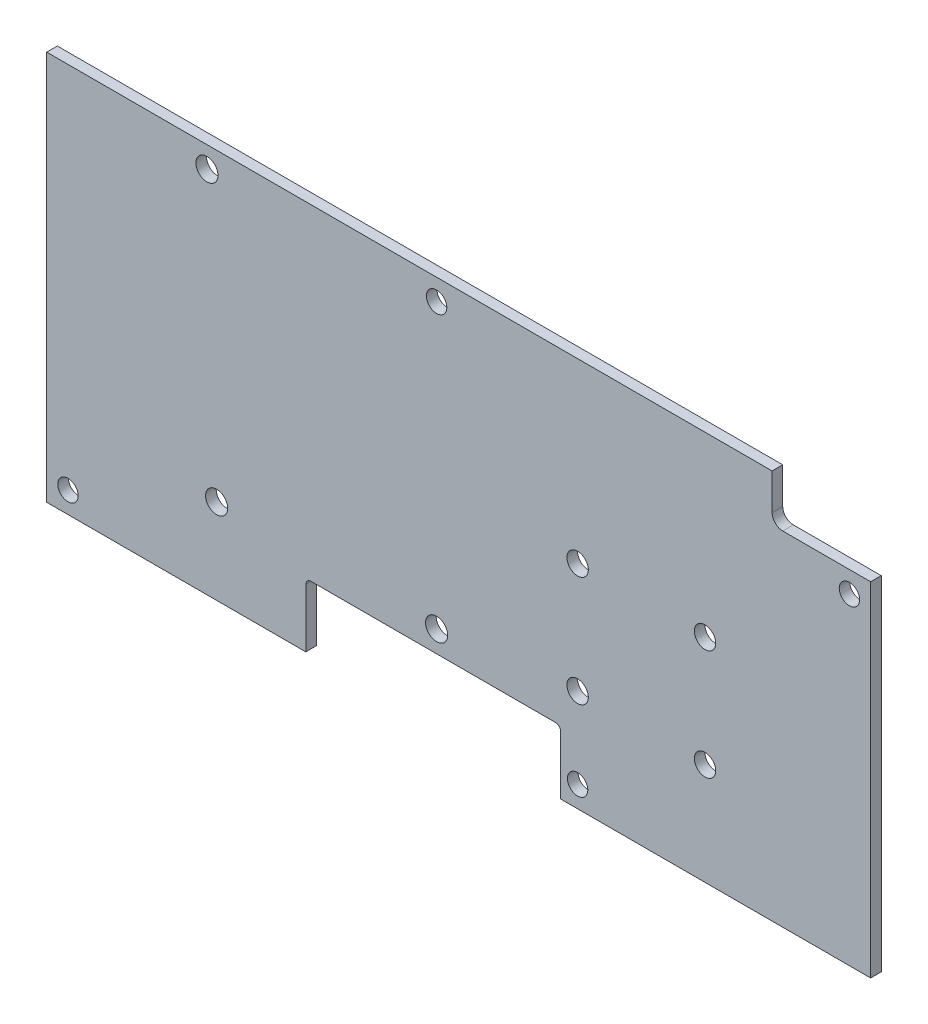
ISO-10303-21;
HEADER;
FILE_DESCRIPTION(('STEP AP214'),'2;1');
FILE_NAME('part.step','',(''),(''),'','','');
FILE_SCHEMA(('AUTOMOTIVE_DESIGN { 1 0 10303 214 1 1 1 1 }'));
ENDSEC;
DATA;
#1=APPLICATION_CONTEXT('core data for automotive mechanical design processes');
#2=APPLICATION_PROTOCOL_DEFINITION('international standard','automotive_design',2000,#1);
#3=PRODUCT_CONTEXT('',#1,'mechanical');
#4=PRODUCT('Part','Part','',(#3));
#5=PRODUCT_RELATED_PRODUCT_CATEGORY('part','',(#4));
#6=PRODUCT_DEFINITION_FORMATION('','',#4);
#7=PRODUCT_DEFINITION_CONTEXT('part definition',#1,'design');
#8=PRODUCT_DEFINITION('design','',#6,#7);
#9=PRODUCT_DEFINITION_SHAPE('','',#8);
#10=(LENGTH_UNIT() NAMED_UNIT(*) SI_UNIT(.MILLI.,.METRE.));
#11=(NAMED_UNIT(*) PLANE_ANGLE_UNIT() SI_UNIT($,.RADIAN.));
#12=(NAMED_UNIT(*) SI_UNIT($,.STERADIAN.) SOLID_ANGLE_UNIT());
#13=UNCERTAINTY_MEASURE_WITH_UNIT(LENGTH_MEASURE(1.E-05),#10,'distance_accuracy_value','');
#14=(GEOMETRIC_REPRESENTATION_CONTEXT(3) GLOBAL_UNCERTAINTY_ASSIGNED_CONTEXT((#13)) GLOBAL_UNIT_ASSIGNED_CONTEXT((#10,
#11,#12)) REPRESENTATION_CONTEXT('',''));
#15=CARTESIAN_POINT('',(0.,0.,0.));
#16=DIRECTION('',(0.,0.,1.));
#17=DIRECTION('',(1.,0.,0.));
#18=AXIS2_PLACEMENT_3D('',#15,#16,#17);
#19=CARTESIAN_POINT('',(24.765,48.895,-9.906));
#20=DIRECTION('',(0.,-1.,0.));
#21=DIRECTION('',(0.,0.,-1.));
#22=AXIS2_PLACEMENT_3D('',#19,#20,#21);
#23=PLANE('',#22);
#24=DIRECTION('',(0.,0.,1.));
#25=VECTOR('',#24,1.);
#26=CARTESIAN_POINT('',(101.6,48.895,-9.906));
#27=LINE('',#26,#25);
#28=CARTESIAN_POINT('',(101.6,48.895,0.));
#29=VERTEX_POINT('',#28);
#30=CARTESIAN_POINT('',(101.6,48.895,1.5875));
#31=VERTEX_POINT('',#30);
#32=EDGE_CURVE('E132',#29,#31,#27,.T.);
#33=ORIENTED_EDGE('',*,*,#32,.F.);
#34=DIRECTION('',(-1.,0.,0.));
#35=VECTOR('',#34,1.);
#36=CARTESIAN_POINT('',(0.,48.895,0.));
#37=LINE('',#36,#35);
#38=CARTESIAN_POINT('',(147.955,48.895,0.));
#39=VERTEX_POINT('',#38);
#40=EDGE_CURVE('E162',#39,#29,#37,.T.);
#41=ORIENTED_EDGE('',*,*,#40,.F.);
#42=DIRECTION('',(0.,0.,1.));
#43=VECTOR('',#42,1.);
#44=CARTESIAN_POINT('',(147.955,48.895,-9.906));
#45=LINE('',#44,#43);
#46=CARTESIAN_POINT('',(147.955,48.895,1.5875));
#47=VERTEX_POINT('',#46);
#48=EDGE_CURVE('E153',#39,#47,#45,.T.);
#49=ORIENTED_EDGE('',*,*,#48,.T.);
#50=DIRECTION('',(-1.,0.,0.));
#51=VECTOR('',#50,1.);
#52=CARTESIAN_POINT('',(0.,48.895,1.5875));
#53=LINE('',#52,#51);
#54=EDGE_CURVE('E147',#47,#31,#53,.T.);
#55=ORIENTED_EDGE('',*,*,#54,.T.);
#56=EDGE_LOOP('',(#33,#41,#49,#55));
#57=FACE_BOUND('',#56,.T.);
#58=ADVANCED_FACE('F39',(#57),#23,.T.);
#59=CARTESIAN_POINT('',(0.,165.1,0.));
#60=DIRECTION('',(0.,0.,-1.));
#61=DIRECTION('',(-1.,0.,0.));
#62=AXIS2_PLACEMENT_3D('',#59,#60,#61);
#63=PLANE('',#62);
#64=DIRECTION('',(0.,1.,0.));
#65=VECTOR('',#64,1.);
#66=CARTESIAN_POINT('',(101.6,46.8737804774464,0.));
#67=LINE('',#66,#65);
#68=CARTESIAN_POINT('',(101.6,57.62625,0.));
#69=VERTEX_POINT('',#68);
#70=EDGE_CURVE('E135',#29,#69,#67,.T.);
#71=ORIENTED_EDGE('',*,*,#70,.T.);
#72=CARTESIAN_POINT('',(100.80625,57.62625,0.));
#73=DIRECTION('',(0.,0.,-1.));
#74=DIRECTION('',(-1.,0.,0.));
#75=AXIS2_PLACEMENT_3D('',#72,#73,#74);
#76=CIRCLE('',#75,0.79375);
#77=CARTESIAN_POINT('',(100.80625,58.42,0.));
#78=VERTEX_POINT('',#77);
#79=EDGE_CURVE('E12',#69,#78,#76,.F.);
#80=ORIENTED_EDGE('',*,*,#79,.T.);
#81=DIRECTION('',(-1.,0.,0.));
#82=VECTOR('',#81,1.);
#83=CARTESIAN_POINT('',(101.6,58.42,0.));
#84=LINE('',#83,#82);
#85=CARTESIAN_POINT('',(64.29375,58.42,0.));
#86=VERTEX_POINT('',#85);
#87=EDGE_CURVE('E264',#78,#86,#84,.T.);
#88=ORIENTED_EDGE('',*,*,#87,.T.);
#89=CARTESIAN_POINT('',(64.29375,57.62625,0.));
#90=DIRECTION('',(0.,0.,-1.));
#91=DIRECTION('',(-1.,0.,0.));
#92=AXIS2_PLACEMENT_3D('',#89,#90,#91);
#93=CIRCLE('',#92,0.79375);
#94=CARTESIAN_POINT('',(63.5,57.62625,0.));
#95=VERTEX_POINT('',#94);
#96=EDGE_CURVE('E253',#86,#95,#93,.F.);
#97=ORIENTED_EDGE('',*,*,#96,.T.);
#98=DIRECTION('',(0.,-1.,0.));
#99=VECTOR('',#98,1.);
#100=CARTESIAN_POINT('',(63.5,46.8737804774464,0.));
#101=LINE('',#100,#99);
#102=CARTESIAN_POINT('',(63.5,48.895,0.));
#103=VERTEX_POINT('',#102);
#104=EDGE_CURVE('E262',#95,#103,#101,.T.);
#105=ORIENTED_EDGE('',*,*,#104,.T.);
#106=CARTESIAN_POINT('',(24.765,48.895,0.));
#107=VERTEX_POINT('',#106);
#108=EDGE_CURVE('E362',#103,#107,#37,.T.);
#109=ORIENTED_EDGE('',*,*,#108,.T.);
#110=DIRECTION('',(0.,1.,0.));
#111=VECTOR('',#110,1.);
#112=CARTESIAN_POINT('',(24.765,165.1,0.));
#113=LINE('',#112,#111);
#114=CARTESIAN_POINT('',(24.765,107.188,0.));
#115=VERTEX_POINT('',#114);
#116=EDGE_CURVE('E172',#107,#115,#113,.T.);
#117=ORIENTED_EDGE('',*,*,#116,.T.);
#118=DIRECTION('',(1.,0.,0.));
#119=VECTOR('',#118,1.);
#120=CARTESIAN_POINT('',(0.,107.188,0.));
#121=LINE('',#120,#119);
#122=CARTESIAN_POINT('',(133.223,107.188,0.));
#123=VERTEX_POINT('',#122);
#124=EDGE_CURVE('E168',#115,#123,#121,.T.);
#125=ORIENTED_EDGE('',*,*,#124,.T.);
#126=DIRECTION('',(0.,-1.,0.));
#127=VECTOR('',#126,1.);
#128=CARTESIAN_POINT('',(133.223,100.203,0.));
#129=LINE('',#128,#127);
#130=CARTESIAN_POINT('',(133.223,101.7905,0.));
#131=VERTEX_POINT('',#130);
#132=EDGE_CURVE('E344',#123,#131,#129,.T.);
#133=ORIENTED_EDGE('',*,*,#132,.T.);
#134=CARTESIAN_POINT('',(134.8105,101.7905,0.));
#135=DIRECTION('',(0.,0.,-1.));
#136=DIRECTION('',(-1.,0.,0.));
#137=AXIS2_PLACEMENT_3D('',#134,#135,#136);
#138=CIRCLE('',#137,1.5875);
#139=CARTESIAN_POINT('',(134.8105,100.203,0.));
#140=VERTEX_POINT('',#139);
#141=EDGE_CURVE('E232',#131,#140,#138,.F.);
#142=ORIENTED_EDGE('',*,*,#141,.T.);
#143=DIRECTION('',(1.,0.,0.));
#144=VECTOR('',#143,1.);
#145=CARTESIAN_POINT('',(150.814561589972,100.203,0.));
#146=LINE('',#145,#144);
#147=CARTESIAN_POINT('',(147.955,100.203,0.));
#148=VERTEX_POINT('',#147);
#149=EDGE_CURVE('E348',#140,#148,#146,.T.);
#150=ORIENTED_EDGE('',*,*,#149,.T.);
#151=DIRECTION('',(0.,-1.,0.));
#152=VECTOR('',#151,1.);
#153=CARTESIAN_POINT('',(147.955,165.1,0.));
#154=LINE('',#153,#152);
#155=EDGE_CURVE('E155',#148,#39,#154,.T.);
#156=ORIENTED_EDGE('',*,*,#155,.T.);
#157=ORIENTED_EDGE('',*,*,#40,.T.);
#158=EDGE_LOOP('',(#71,#80,#88,#97,#105,#109,#117,#125,#133,#142,#150,#156,#157));
#159=FACE_BOUND('',#158,.T.);
#160=CARTESIAN_POINT('',(104.14,80.645,0.));
#161=DIRECTION('',(0.,0.,1.));
#162=DIRECTION('',(1.,0.,0.));
#163=AXIS2_PLACEMENT_3D('',#160,#161,#162);
#164=CIRCLE('',#163,1.6002);
#165=CARTESIAN_POINT('',(105.7402,80.645,0.));
#166=VERTEX_POINT('',#165);
#167=EDGE_CURVE('E296',#166,#166,#164,.T.);
#168=ORIENTED_EDGE('',*,*,#167,.T.);
#169=EDGE_LOOP('',(#168));
#170=FACE_BOUND('',#169,.T.);
#171=CARTESIAN_POINT('',(123.19,64.135,0.));
#172=DIRECTION('',(0.,0.,1.));
#173=DIRECTION('',(1.,0.,0.));
#174=AXIS2_PLACEMENT_3D('',#171,#172,#173);
#175=CIRCLE('',#174,1.6002);
#176=CARTESIAN_POINT('',(124.7902,64.135,0.));
#177=VERTEX_POINT('',#176);
#178=EDGE_CURVE('E305',#177,#177,#175,.T.);
#179=ORIENTED_EDGE('',*,*,#178,.T.);
#180=EDGE_LOOP('',(#179));
#181=FACE_BOUND('',#180,.T.);
#182=CARTESIAN_POINT('',(123.19,80.645,0.));
#183=DIRECTION('',(0.,0.,1.));
#184=DIRECTION('',(1.,0.,0.));
#185=AXIS2_PLACEMENT_3D('',#182,#183,#184);
#186=CIRCLE('',#185,1.6002);
#187=CARTESIAN_POINT('',(124.7902,80.645,0.));
#188=VERTEX_POINT('',#187);
#189=EDGE_CURVE('E288',#188,#188,#186,.T.);
#190=ORIENTED_EDGE('',*,*,#189,.T.);
#191=EDGE_LOOP('',(#190));
#192=FACE_BOUND('',#191,.T.);
#193=CARTESIAN_POINT('',(104.14,64.135,0.));
#194=DIRECTION('',(0.,0.,1.));
#195=DIRECTION('',(1.,0.,0.));
#196=AXIS2_PLACEMENT_3D('',#193,#194,#195);
#197=CIRCLE('',#196,1.6002);
#198=CARTESIAN_POINT('',(105.7402,64.135,0.));
#199=VERTEX_POINT('',#198);
#200=EDGE_CURVE('E312',#199,#199,#197,.T.);
#201=ORIENTED_EDGE('',*,*,#200,.T.);
#202=EDGE_LOOP('',(#201));
#203=FACE_BOUND('',#202,.T.);
#204=CARTESIAN_POINT('',(48.7172,104.013,0.));
#205=DIRECTION('',(0.,0.,1.));
#206=DIRECTION('',(1.,0.,0.));
#207=AXIS2_PLACEMENT_3D('',#204,#205,#206);
#208=CIRCLE('',#207,1.65100000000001);
#209=CARTESIAN_POINT('',(50.3682,104.013,0.));
#210=VERTEX_POINT('',#209);
#211=EDGE_CURVE('E320',#210,#210,#208,.T.);
#212=ORIENTED_EDGE('',*,*,#211,.T.);
#213=EDGE_LOOP('',(#212));
#214=FACE_BOUND('',#213,.T.);
#215=CARTESIAN_POINT('',(50.165,61.6458,0.));
#216=DIRECTION('',(0.,0.,1.));
#217=DIRECTION('',(1.,0.,0.));
#218=AXIS2_PLACEMENT_3D('',#215,#216,#217);
#219=CIRCLE('',#218,1.651);
#220=CARTESIAN_POINT('',(51.816,61.6458,0.));
#221=VERTEX_POINT('',#220);
#222=EDGE_CURVE('E329',#221,#221,#219,.T.);
#223=ORIENTED_EDGE('',*,*,#222,.T.);
#224=EDGE_LOOP('',(#223));
#225=FACE_BOUND('',#224,.T.);
#226=CARTESIAN_POINT('',(83.058,61.6458,0.));
#227=DIRECTION('',(0.,0.,1.));
#228=DIRECTION('',(1.,0.,0.));
#229=AXIS2_PLACEMENT_3D('',#226,#227,#228);
#230=CIRCLE('',#229,1.65100000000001);
#231=CARTESIAN_POINT('',(84.709,61.6458,0.));
#232=VERTEX_POINT('',#231);
#233=EDGE_CURVE('E337',#232,#232,#230,.T.);
#234=ORIENTED_EDGE('',*,*,#233,.T.);
#235=EDGE_LOOP('',(#234));
#236=FACE_BOUND('',#235,.T.);
#237=CARTESIAN_POINT('',(27.94,52.07,0.));
#238=DIRECTION('',(0.,0.,-1.));
#239=DIRECTION('',(-1.,0.,0.));
#240=AXIS2_PLACEMENT_3D('',#237,#238,#239);
#241=CIRCLE('',#240,1.524);
#242=CARTESIAN_POINT('',(26.416,52.07,0.));
#243=VERTEX_POINT('',#242);
#244=EDGE_CURVE('E195',#243,#243,#241,.T.);
#245=ORIENTED_EDGE('',*,*,#244,.F.);
#246=EDGE_LOOP('',(#245));
#247=FACE_BOUND('',#246,.T.);
#248=CARTESIAN_POINT('',(104.14,52.07,0.));
#249=DIRECTION('',(0.,0.,-1.));
#250=DIRECTION('',(-1.,0.,0.));
#251=AXIS2_PLACEMENT_3D('',#248,#249,#250);
#252=CIRCLE('',#251,1.52399999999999);
#253=CARTESIAN_POINT('',(102.616,52.07,0.));
#254=VERTEX_POINT('',#253);
#255=EDGE_CURVE('E190',#254,#254,#252,.T.);
#256=ORIENTED_EDGE('',*,*,#255,.F.);
#257=EDGE_LOOP('',(#256));
#258=FACE_BOUND('',#257,.T.);
#259=CARTESIAN_POINT('',(144.78,97.028,0.));
#260=DIRECTION('',(0.,0.,-1.));
#261=DIRECTION('',(-1.,0.,0.));
#262=AXIS2_PLACEMENT_3D('',#259,#260,#261);
#263=CIRCLE('',#262,1.52400000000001);
#264=CARTESIAN_POINT('',(143.256,97.028,0.));
#265=VERTEX_POINT('',#264);
#266=EDGE_CURVE('E185',#265,#265,#263,.T.);
#267=ORIENTED_EDGE('',*,*,#266,.F.);
#268=EDGE_LOOP('',(#267));
#269=FACE_BOUND('',#268,.T.);
#270=CARTESIAN_POINT('',(83.058,104.013,0.));
#271=DIRECTION('',(0.,0.,-1.));
#272=DIRECTION('',(-1.,0.,0.));
#273=AXIS2_PLACEMENT_3D('',#270,#271,#272);
#274=CIRCLE('',#273,1.52399999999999);
#275=CARTESIAN_POINT('',(81.534,104.013,0.));
#276=VERTEX_POINT('',#275);
#277=EDGE_CURVE('E180',#276,#276,#274,.T.);
#278=ORIENTED_EDGE('',*,*,#277,.F.);
#279=EDGE_LOOP('',(#278));
#280=FACE_BOUND('',#279,.T.);
#281=ADVANCED_FACE('F260',(#159,#170,#181,#192,#203,#214,#225,#236,#247,#258,#269,#280),#63,.T.);
#282=CARTESIAN_POINT('',(0.,165.1,1.5875));
#283=DIRECTION('',(0.,0.,-1.));
#284=DIRECTION('',(-1.,0.,0.));
#285=AXIS2_PLACEMENT_3D('',#282,#283,#284);
#286=PLANE('',#285);
#287=CARTESIAN_POINT('',(104.14,80.645,1.5875));
#288=DIRECTION('',(0.,0.,1.));
#289=DIRECTION('',(1.,0.,0.));
#290=AXIS2_PLACEMENT_3D('',#287,#288,#289);
#291=CIRCLE('',#290,1.6002);
#292=CARTESIAN_POINT('',(105.7402,80.645,1.5875));
#293=VERTEX_POINT('',#292);
#294=EDGE_CURVE('E301',#293,#293,#291,.T.);
#295=ORIENTED_EDGE('',*,*,#294,.F.);
#296=EDGE_LOOP('',(#295));
#297=FACE_BOUND('',#296,.T.);
#298=CARTESIAN_POINT('',(123.19,64.135,1.5875));
#299=DIRECTION('',(0.,0.,1.));
#300=DIRECTION('',(1.,0.,0.));
#301=AXIS2_PLACEMENT_3D('',#298,#299,#300);
#302=CIRCLE('',#301,1.6002);
#303=CARTESIAN_POINT('',(124.7902,64.135,1.5875));
#304=VERTEX_POINT('',#303);
#305=EDGE_CURVE('E292',#304,#304,#302,.T.);
#306=ORIENTED_EDGE('',*,*,#305,.F.);
#307=EDGE_LOOP('',(#306));
#308=FACE_BOUND('',#307,.T.);
#309=CARTESIAN_POINT('',(123.19,80.645,1.5875));
#310=DIRECTION('',(0.,0.,1.));
#311=DIRECTION('',(1.,0.,0.));
#312=AXIS2_PLACEMENT_3D('',#309,#310,#311);
#313=CIRCLE('',#312,1.6002);
#314=CARTESIAN_POINT('',(124.7902,80.645,1.5875));
#315=VERTEX_POINT('',#314);
#316=EDGE_CURVE('E274',#315,#315,#313,.T.);
#317=ORIENTED_EDGE('',*,*,#316,.F.);
#318=EDGE_LOOP('',(#317));
#319=FACE_BOUND('',#318,.T.);
#320=CARTESIAN_POINT('',(104.14,64.135,1.5875));
#321=DIRECTION('',(0.,0.,1.));
#322=DIRECTION('',(1.,0.,0.));
#323=AXIS2_PLACEMENT_3D('',#320,#321,#322);
#324=CIRCLE('',#323,1.6002);
#325=CARTESIAN_POINT('',(105.7402,64.135,1.5875));
#326=VERTEX_POINT('',#325);
#327=EDGE_CURVE('E300',#326,#326,#324,.T.);
#328=ORIENTED_EDGE('',*,*,#327,.F.);
#329=EDGE_LOOP('',(#328));
#330=FACE_BOUND('',#329,.T.);
#331=CARTESIAN_POINT('',(48.7172,104.013,1.5875));
#332=DIRECTION('',(0.,0.,1.));
#333=DIRECTION('',(1.,0.,0.));
#334=AXIS2_PLACEMENT_3D('',#331,#332,#333);
#335=CIRCLE('',#334,1.65100000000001);
#336=CARTESIAN_POINT('',(50.3682,104.013,1.5875));
#337=VERTEX_POINT('',#336);
#338=EDGE_CURVE('E325',#337,#337,#335,.T.);
#339=ORIENTED_EDGE('',*,*,#338,.F.);
#340=EDGE_LOOP('',(#339));
#341=FACE_BOUND('',#340,.T.);
#342=CARTESIAN_POINT('',(50.165,61.6458,1.5875));
#343=DIRECTION('',(0.,0.,1.));
#344=DIRECTION('',(1.,0.,0.));
#345=AXIS2_PLACEMENT_3D('',#342,#343,#344);
#346=CIRCLE('',#345,1.651);
#347=CARTESIAN_POINT('',(51.816,61.6458,1.5875));
#348=VERTEX_POINT('',#347);
#349=EDGE_CURVE('E333',#348,#348,#346,.T.);
#350=ORIENTED_EDGE('',*,*,#349,.F.);
#351=EDGE_LOOP('',(#350));
#352=FACE_BOUND('',#351,.T.);
#353=CARTESIAN_POINT('',(83.058,61.6458,1.5875));
#354=DIRECTION('',(0.,0.,1.));
#355=DIRECTION('',(1.,0.,0.));
#356=AXIS2_PLACEMENT_3D('',#353,#354,#355);
#357=CIRCLE('',#356,1.65100000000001);
#358=CARTESIAN_POINT('',(84.709,61.6458,1.5875));
#359=VERTEX_POINT('',#358);
#360=EDGE_CURVE('E316',#359,#359,#357,.T.);
#361=ORIENTED_EDGE('',*,*,#360,.F.);
#362=EDGE_LOOP('',(#361));
#363=FACE_BOUND('',#362,.T.);
#364=CARTESIAN_POINT('',(27.94,52.07,1.5875));
#365=DIRECTION('',(0.,0.,1.));
#366=DIRECTION('',(1.,0.,0.));
#367=AXIS2_PLACEMENT_3D('',#364,#365,#366);
#368=CIRCLE('',#367,1.524);
#369=CARTESIAN_POINT('',(29.464,52.07,1.5875));
#370=VERTEX_POINT('',#369);
#371=EDGE_CURVE('E191',#370,#370,#368,.T.);
#372=ORIENTED_EDGE('',*,*,#371,.F.);
#373=EDGE_LOOP('',(#372));
#374=FACE_BOUND('',#373,.T.);
#375=CARTESIAN_POINT('',(104.14,52.07,1.5875));
#376=DIRECTION('',(0.,0.,1.));
#377=DIRECTION('',(1.,0.,0.));
#378=AXIS2_PLACEMENT_3D('',#375,#376,#377);
#379=CIRCLE('',#378,1.52399999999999);
#380=CARTESIAN_POINT('',(105.664,52.07,1.5875));
#381=VERTEX_POINT('',#380);
#382=EDGE_CURVE('E186',#381,#381,#379,.T.);
#383=ORIENTED_EDGE('',*,*,#382,.F.);
#384=EDGE_LOOP('',(#383));
#385=FACE_BOUND('',#384,.T.);
#386=CARTESIAN_POINT('',(144.78,97.028,1.5875));
#387=DIRECTION('',(0.,0.,1.));
#388=DIRECTION('',(-1.,0.,0.));
#389=AXIS2_PLACEMENT_3D('',#386,#387,#388);
#390=CIRCLE('',#389,1.52400000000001);
#391=CARTESIAN_POINT('',(143.256,97.028,1.5875));
#392=VERTEX_POINT('',#391);
#393=EDGE_CURVE('E181',#392,#392,#390,.T.);
#394=ORIENTED_EDGE('',*,*,#393,.F.);
#395=EDGE_LOOP('',(#394));
#396=FACE_BOUND('',#395,.T.);
#397=CARTESIAN_POINT('',(83.058,104.013,1.5875));
#398=DIRECTION('',(0.,0.,1.));
#399=DIRECTION('',(-1.,0.,0.));
#400=AXIS2_PLACEMENT_3D('',#397,#398,#399);
#401=CIRCLE('',#400,1.52399999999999);
#402=CARTESIAN_POINT('',(81.534,104.013,1.5875));
#403=VERTEX_POINT('',#402);
#404=EDGE_CURVE('E176',#403,#403,#401,.T.);
#405=ORIENTED_EDGE('',*,*,#404,.F.);
#406=EDGE_LOOP('',(#405));
#407=FACE_BOUND('',#406,.T.);
#408=DIRECTION('',(-1.,0.,0.));
#409=VECTOR('',#408,1.);
#410=CARTESIAN_POINT('',(101.6,58.42,1.5875));
#411=LINE('',#410,#409);
#412=CARTESIAN_POINT('',(100.80625,58.42,1.5875));
#413=VERTEX_POINT('',#412);
#414=CARTESIAN_POINT('',(64.29375,58.42,1.5875));
#415=VERTEX_POINT('',#414);
#416=EDGE_CURVE('E149',#413,#415,#411,.T.);
#417=ORIENTED_EDGE('',*,*,#416,.F.);
#418=CARTESIAN_POINT('',(100.80625,57.62625,1.5875));
#419=DIRECTION('',(0.,0.,-1.));
#420=DIRECTION('',(-1.,0.,0.));
#421=AXIS2_PLACEMENT_3D('',#418,#419,#420);
#422=CIRCLE('',#421,0.79375);
#423=CARTESIAN_POINT('',(101.6,57.62625,1.5875));
#424=VERTEX_POINT('',#423);
#425=EDGE_CURVE('E48',#413,#424,#422,.T.);
#426=ORIENTED_EDGE('',*,*,#425,.T.);
#427=DIRECTION('',(0.,1.,0.));
#428=VECTOR('',#427,1.);
#429=CARTESIAN_POINT('',(101.6,46.8737804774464,1.5875));
#430=LINE('',#429,#428);
#431=EDGE_CURVE('E134',#31,#424,#430,.T.);
#432=ORIENTED_EDGE('',*,*,#431,.F.);
#433=ORIENTED_EDGE('',*,*,#54,.F.);
#434=DIRECTION('',(0.,-1.,0.));
#435=VECTOR('',#434,1.);
#436=CARTESIAN_POINT('',(147.955,165.1,1.5875));
#437=LINE('',#436,#435);
#438=CARTESIAN_POINT('',(147.955,100.203,1.5875));
#439=VERTEX_POINT('',#438);
#440=EDGE_CURVE('E160',#439,#47,#437,.T.);
#441=ORIENTED_EDGE('',*,*,#440,.F.);
#442=DIRECTION('',(1.,0.,0.));
#443=VECTOR('',#442,1.);
#444=CARTESIAN_POINT('',(150.814561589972,100.203,1.5875));
#445=LINE('',#444,#443);
#446=CARTESIAN_POINT('',(134.8105,100.203,1.5875));
#447=VERTEX_POINT('',#446);
#448=EDGE_CURVE('E349',#447,#439,#445,.T.);
#449=ORIENTED_EDGE('',*,*,#448,.F.);
#450=CARTESIAN_POINT('',(134.8105,101.7905,1.5875));
#451=DIRECTION('',(0.,0.,-1.));
#452=DIRECTION('',(-1.,0.,0.));
#453=AXIS2_PLACEMENT_3D('',#450,#451,#452);
#454=CIRCLE('',#453,1.5875);
#455=CARTESIAN_POINT('',(133.223,101.7905,1.5875));
#456=VERTEX_POINT('',#455);
#457=EDGE_CURVE('E229',#447,#456,#454,.T.);
#458=ORIENTED_EDGE('',*,*,#457,.T.);
#459=DIRECTION('',(0.,-1.,0.));
#460=VECTOR('',#459,1.);
#461=CARTESIAN_POINT('',(133.223,100.203,1.5875));
#462=LINE('',#461,#460);
#463=CARTESIAN_POINT('',(133.223,107.188,1.5875));
#464=VERTEX_POINT('',#463);
#465=EDGE_CURVE('E324',#464,#456,#462,.T.);
#466=ORIENTED_EDGE('',*,*,#465,.F.);
#467=DIRECTION('',(1.,0.,0.));
#468=VECTOR('',#467,1.);
#469=CARTESIAN_POINT('',(0.,107.188,1.5875));
#470=LINE('',#469,#468);
#471=CARTESIAN_POINT('',(24.765,107.188,1.5875));
#472=VERTEX_POINT('',#471);
#473=EDGE_CURVE('E199',#472,#464,#470,.T.);
#474=ORIENTED_EDGE('',*,*,#473,.F.);
#475=DIRECTION('',(0.,1.,0.));
#476=VECTOR('',#475,1.);
#477=CARTESIAN_POINT('',(24.765,165.1,1.5875));
#478=LINE('',#477,#476);
#479=CARTESIAN_POINT('',(24.765,48.895,1.5875));
#480=VERTEX_POINT('',#479);
#481=EDGE_CURVE('E212',#480,#472,#478,.T.);
#482=ORIENTED_EDGE('',*,*,#481,.F.);
#483=CARTESIAN_POINT('',(63.5,48.895,1.5875));
#484=VERTEX_POINT('',#483);
#485=EDGE_CURVE('E156',#484,#480,#53,.T.);
#486=ORIENTED_EDGE('',*,*,#485,.F.);
#487=DIRECTION('',(0.,-1.,0.));
#488=VECTOR('',#487,1.);
#489=CARTESIAN_POINT('',(63.5,46.8737804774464,1.5875));
#490=LINE('',#489,#488);
#491=CARTESIAN_POINT('',(63.5,57.62625,1.5875));
#492=VERTEX_POINT('',#491);
#493=EDGE_CURVE('E279',#492,#484,#490,.T.);
#494=ORIENTED_EDGE('',*,*,#493,.F.);
#495=CARTESIAN_POINT('',(64.29375,57.62625,1.5875));
#496=DIRECTION('',(0.,0.,-1.));
#497=DIRECTION('',(-1.,0.,0.));
#498=AXIS2_PLACEMENT_3D('',#495,#496,#497);
#499=CIRCLE('',#498,0.79375);
#500=EDGE_CURVE('E250',#492,#415,#499,.T.);
#501=ORIENTED_EDGE('',*,*,#500,.T.);
#502=EDGE_LOOP('',(#417,#426,#432,#433,#441,#449,#458,#466,#474,#482,#486,#494,#501));
#503=FACE_BOUND('',#502,.T.);
#504=ADVANCED_FACE('F145',(#297,#308,#319,#330,#341,#352,#363,#374,#385,#396,#407,#503),#286,.F.);
#505=CARTESIAN_POINT('',(27.94,52.07,-8.5725));
#506=DIRECTION('',(0.,0.,1.));
#507=DIRECTION('',(1.,0.,0.));
#508=AXIS2_PLACEMENT_3D('',#505,#506,#507);
#509=CYLINDRICAL_SURFACE('',#508,1.524);
#510=ORIENTED_EDGE('',*,*,#244,.T.);
#511=EDGE_LOOP('',(#510));
#512=FACE_BOUND('',#511,.T.);
#513=ORIENTED_EDGE('',*,*,#371,.T.);
#514=EDGE_LOOP('',(#513));
#515=FACE_BOUND('',#514,.T.);
#516=ADVANCED_FACE('F441',(#512,#515),#509,.F.);
#517=CARTESIAN_POINT('',(104.14,52.07,-8.5725));
#518=DIRECTION('',(0.,0.,1.));
#519=DIRECTION('',(1.,0.,0.));
#520=AXIS2_PLACEMENT_3D('',#517,#518,#519);
#521=CYLINDRICAL_SURFACE('',#520,1.52399999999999);
#522=ORIENTED_EDGE('',*,*,#255,.T.);
#523=EDGE_LOOP('',(#522));
#524=FACE_BOUND('',#523,.T.);
#525=ORIENTED_EDGE('',*,*,#382,.T.);
#526=EDGE_LOOP('',(#525));
#527=FACE_BOUND('',#526,.T.);
#528=ADVANCED_FACE('F437',(#524,#527),#521,.F.);
#529=CARTESIAN_POINT('',(144.78,97.028,-4.0005));
#530=DIRECTION('',(0.,0.,1.));
#531=DIRECTION('',(1.,0.,0.));
#532=AXIS2_PLACEMENT_3D('',#529,#530,#531);
#533=CYLINDRICAL_SURFACE('',#532,1.52400000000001);
#534=ORIENTED_EDGE('',*,*,#266,.T.);
#535=EDGE_LOOP('',(#534));
#536=FACE_BOUND('',#535,.T.);
#537=ORIENTED_EDGE('',*,*,#393,.T.);
#538=EDGE_LOOP('',(#537));
#539=FACE_BOUND('',#538,.T.);
#540=ADVANCED_FACE('F431',(#536,#539),#533,.F.);
#541=CARTESIAN_POINT('',(83.058,104.013,-4.0005));
#542=DIRECTION('',(0.,0.,1.));
#543=DIRECTION('',(1.,0.,0.));
#544=AXIS2_PLACEMENT_3D('',#541,#542,#543);
#545=CYLINDRICAL_SURFACE('',#544,1.52399999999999);
#546=ORIENTED_EDGE('',*,*,#277,.T.);
#547=EDGE_LOOP('',(#546));
#548=FACE_BOUND('',#547,.T.);
#549=ORIENTED_EDGE('',*,*,#404,.T.);
#550=EDGE_LOOP('',(#549));
#551=FACE_BOUND('',#550,.T.);
#552=ADVANCED_FACE('F428',(#548,#551),#545,.F.);
#553=CARTESIAN_POINT('',(24.765,48.895,-9.906));
#554=DIRECTION('',(-1.,0.,0.));
#555=DIRECTION('',(0.,0.,1.));
#556=AXIS2_PLACEMENT_3D('',#553,#554,#555);
#557=PLANE('',#556);
#558=DIRECTION('',(0.,0.,1.));
#559=VECTOR('',#558,1.);
#560=CARTESIAN_POINT('',(24.765,48.895,-9.906));
#561=LINE('',#560,#559);
#562=EDGE_CURVE('E352',#107,#480,#561,.T.);
#563=ORIENTED_EDGE('',*,*,#562,.T.);
#564=ORIENTED_EDGE('',*,*,#481,.T.);
#565=DIRECTION('',(0.,0.,1.));
#566=VECTOR('',#565,1.);
#567=CARTESIAN_POINT('',(24.765,107.188,-9.906));
#568=LINE('',#567,#566);
#569=EDGE_CURVE('E358',#115,#472,#568,.T.);
#570=ORIENTED_EDGE('',*,*,#569,.F.);
#571=ORIENTED_EDGE('',*,*,#116,.F.);
#572=EDGE_LOOP('',(#563,#564,#570,#571));
#573=FACE_BOUND('',#572,.T.);
#574=ADVANCED_FACE('F370',(#573),#557,.T.);
#575=CARTESIAN_POINT('',(24.765,107.188,-9.906));
#576=DIRECTION('',(0.,1.,0.));
#577=DIRECTION('',(0.,0.,1.));
#578=AXIS2_PLACEMENT_3D('',#575,#576,#577);
#579=PLANE('',#578);
#580=DIRECTION('',(0.,0.,1.));
#581=VECTOR('',#580,1.);
#582=CARTESIAN_POINT('',(133.223,107.188,-9.906));
#583=LINE('',#582,#581);
#584=EDGE_CURVE('E219',#123,#464,#583,.T.);
#585=ORIENTED_EDGE('',*,*,#584,.F.);
#586=ORIENTED_EDGE('',*,*,#124,.F.);
#587=ORIENTED_EDGE('',*,*,#569,.T.);
#588=ORIENTED_EDGE('',*,*,#473,.T.);
#589=EDGE_LOOP('',(#585,#586,#587,#588));
#590=FACE_BOUND('',#589,.T.);
#591=ADVANCED_FACE('F377',(#590),#579,.T.);
#592=CARTESIAN_POINT('',(147.955,48.895,-9.906));
#593=DIRECTION('',(1.,0.,0.));
#594=DIRECTION('',(0.,0.,-1.));
#595=AXIS2_PLACEMENT_3D('',#592,#593,#594);
#596=PLANE('',#595);
#597=DIRECTION('',(0.,0.,-1.));
#598=VECTOR('',#597,1.);
#599=CARTESIAN_POINT('',(147.955,100.203,-9.906));
#600=LINE('',#599,#598);
#601=EDGE_CURVE('E215',#439,#148,#600,.T.);
#602=ORIENTED_EDGE('',*,*,#601,.F.);
#603=ORIENTED_EDGE('',*,*,#440,.T.);
#604=ORIENTED_EDGE('',*,*,#48,.F.);
#605=ORIENTED_EDGE('',*,*,#155,.F.);
#606=EDGE_LOOP('',(#602,#603,#604,#605));
#607=FACE_BOUND('',#606,.T.);
#608=ADVANCED_FACE('F384',(#607),#596,.T.);
#609=DIRECTION('',(0.,0.,-1.));
#610=VECTOR('',#609,1.);
#611=CARTESIAN_POINT('',(63.5,48.895,-9.906));
#612=LINE('',#611,#610);
#613=EDGE_CURVE('E142',#484,#103,#612,.T.);
#614=ORIENTED_EDGE('',*,*,#613,.F.);
#615=ORIENTED_EDGE('',*,*,#485,.T.);
#616=ORIENTED_EDGE('',*,*,#562,.F.);
#617=ORIENTED_EDGE('',*,*,#108,.F.);
#618=EDGE_LOOP('',(#614,#615,#616,#617));
#619=FACE_BOUND('',#618,.T.);
#620=ADVANCED_FACE('F404',(#619),#23,.T.);
#621=CARTESIAN_POINT('',(150.814561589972,100.203,0.));
#622=DIRECTION('',(0.,-1.,0.));
#623=DIRECTION('',(0.,0.,-1.));
#624=AXIS2_PLACEMENT_3D('',#621,#622,#623);
#625=PLANE('',#624);
#626=ORIENTED_EDGE('',*,*,#149,.F.);
#627=DIRECTION('',(0.,0.,1.));
#628=VECTOR('',#627,1.);
#629=CARTESIAN_POINT('',(134.8105,100.203,1.5875));
#630=LINE('',#629,#628);
#631=EDGE_CURVE('E222',#140,#447,#630,.T.);
#632=ORIENTED_EDGE('',*,*,#631,.T.);
#633=ORIENTED_EDGE('',*,*,#448,.T.);
#634=ORIENTED_EDGE('',*,*,#601,.T.);
#635=EDGE_LOOP('',(#626,#632,#633,#634));
#636=FACE_BOUND('',#635,.T.);
#637=ADVANCED_FACE('F388',(#636),#625,.F.);
#638=CARTESIAN_POINT('',(133.223,100.203,0.));
#639=DIRECTION('',(-1.,0.,0.));
#640=DIRECTION('',(0.,0.,1.));
#641=AXIS2_PLACEMENT_3D('',#638,#639,#640);
#642=PLANE('',#641);
#643=ORIENTED_EDGE('',*,*,#465,.T.);
#644=DIRECTION('',(0.,0.,1.));
#645=VECTOR('',#644,1.);
#646=CARTESIAN_POINT('',(133.223,101.7905,0.));
#647=LINE('',#646,#645);
#648=EDGE_CURVE('E226',#456,#131,#647,.F.);
#649=ORIENTED_EDGE('',*,*,#648,.T.);
#650=ORIENTED_EDGE('',*,*,#132,.F.);
#651=ORIENTED_EDGE('',*,*,#584,.T.);
#652=EDGE_LOOP('',(#643,#649,#650,#651));
#653=FACE_BOUND('',#652,.T.);
#654=ADVANCED_FACE('F395',(#653),#642,.F.);
#655=CARTESIAN_POINT('',(134.8105,101.7905,0.));
#656=DIRECTION('',(0.,0.,-1.));
#657=DIRECTION('',(-1.,0.,0.));
#658=AXIS2_PLACEMENT_3D('',#655,#656,#657);
#659=CYLINDRICAL_SURFACE('',#658,1.5875);
#660=ORIENTED_EDGE('',*,*,#141,.F.);
#661=ORIENTED_EDGE('',*,*,#648,.F.);
#662=ORIENTED_EDGE('',*,*,#457,.F.);
#663=ORIENTED_EDGE('',*,*,#631,.F.);
#664=EDGE_LOOP('',(#660,#661,#662,#663));
#665=FACE_BOUND('',#664,.T.);
#666=ADVANCED_FACE('F392',(#665),#659,.F.);
#667=CARTESIAN_POINT('',(83.058,61.6458,0.));
#668=DIRECTION('',(0.,0.,1.));
#669=DIRECTION('',(1.,0.,0.));
#670=AXIS2_PLACEMENT_3D('',#667,#668,#669);
#671=CYLINDRICAL_SURFACE('',#670,1.65100000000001);
#672=ORIENTED_EDGE('',*,*,#233,.F.);
#673=EDGE_LOOP('',(#672));
#674=FACE_BOUND('',#673,.T.);
#675=ORIENTED_EDGE('',*,*,#360,.T.);
#676=EDGE_LOOP('',(#675));
#677=FACE_BOUND('',#676,.T.);
#678=ADVANCED_FACE('F402',(#674,#677),#671,.F.);
#679=CARTESIAN_POINT('',(50.165,61.6458,0.));
#680=DIRECTION('',(0.,0.,1.));
#681=DIRECTION('',(1.,0.,0.));
#682=AXIS2_PLACEMENT_3D('',#679,#680,#681);
#683=CYLINDRICAL_SURFACE('',#682,1.651);
#684=ORIENTED_EDGE('',*,*,#222,.F.);
#685=EDGE_LOOP('',(#684));
#686=FACE_BOUND('',#685,.T.);
#687=ORIENTED_EDGE('',*,*,#349,.T.);
#688=EDGE_LOOP('',(#687));
#689=FACE_BOUND('',#688,.T.);
#690=ADVANCED_FACE('F481',(#686,#689),#683,.F.);
#691=CARTESIAN_POINT('',(48.7172,104.013,0.));
#692=DIRECTION('',(0.,0.,1.));
#693=DIRECTION('',(1.,0.,0.));
#694=AXIS2_PLACEMENT_3D('',#691,#692,#693);
#695=CYLINDRICAL_SURFACE('',#694,1.65100000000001);
#696=ORIENTED_EDGE('',*,*,#211,.F.);
#697=EDGE_LOOP('',(#696));
#698=FACE_BOUND('',#697,.T.);
#699=ORIENTED_EDGE('',*,*,#338,.T.);
#700=EDGE_LOOP('',(#699));
#701=FACE_BOUND('',#700,.T.);
#702=ADVANCED_FACE('F477',(#698,#701),#695,.F.);
#703=CARTESIAN_POINT('',(104.14,64.135,0.));
#704=DIRECTION('',(0.,0.,1.));
#705=DIRECTION('',(1.,0.,0.));
#706=AXIS2_PLACEMENT_3D('',#703,#704,#705);
#707=CYLINDRICAL_SURFACE('',#706,1.6002);
#708=ORIENTED_EDGE('',*,*,#200,.F.);
#709=EDGE_LOOP('',(#708));
#710=FACE_BOUND('',#709,.T.);
#711=ORIENTED_EDGE('',*,*,#327,.T.);
#712=EDGE_LOOP('',(#711));
#713=FACE_BOUND('',#712,.T.);
#714=ADVANCED_FACE('F467',(#710,#713),#707,.F.);
#715=CARTESIAN_POINT('',(123.19,80.645,0.));
#716=DIRECTION('',(0.,0.,1.));
#717=DIRECTION('',(1.,0.,0.));
#718=AXIS2_PLACEMENT_3D('',#715,#716,#717);
#719=CYLINDRICAL_SURFACE('',#718,1.6002);
#720=ORIENTED_EDGE('',*,*,#189,.F.);
#721=EDGE_LOOP('',(#720));
#722=FACE_BOUND('',#721,.T.);
#723=ORIENTED_EDGE('',*,*,#316,.T.);
#724=EDGE_LOOP('',(#723));
#725=FACE_BOUND('',#724,.T.);
#726=ADVANCED_FACE('F463',(#722,#725),#719,.F.);
#727=CARTESIAN_POINT('',(123.19,64.135,0.));
#728=DIRECTION('',(0.,0.,1.));
#729=DIRECTION('',(1.,0.,0.));
#730=AXIS2_PLACEMENT_3D('',#727,#728,#729);
#731=CYLINDRICAL_SURFACE('',#730,1.6002);
#732=ORIENTED_EDGE('',*,*,#178,.F.);
#733=EDGE_LOOP('',(#732));
#734=FACE_BOUND('',#733,.T.);
#735=ORIENTED_EDGE('',*,*,#305,.T.);
#736=EDGE_LOOP('',(#735));
#737=FACE_BOUND('',#736,.T.);
#738=ADVANCED_FACE('F466',(#734,#737),#731,.F.);
#739=CARTESIAN_POINT('',(104.14,80.645,0.));
#740=DIRECTION('',(0.,0.,1.));
#741=DIRECTION('',(1.,0.,0.));
#742=AXIS2_PLACEMENT_3D('',#739,#740,#741);
#743=CYLINDRICAL_SURFACE('',#742,1.6002);
#744=ORIENTED_EDGE('',*,*,#167,.F.);
#745=EDGE_LOOP('',(#744));
#746=FACE_BOUND('',#745,.T.);
#747=ORIENTED_EDGE('',*,*,#294,.T.);
#748=EDGE_LOOP('',(#747));
#749=FACE_BOUND('',#748,.T.);
#750=ADVANCED_FACE('F462',(#746,#749),#743,.F.);
#751=CARTESIAN_POINT('',(101.6,46.8737804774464,0.));
#752=DIRECTION('',(1.,0.,0.));
#753=DIRECTION('',(0.,0.,-1.));
#754=AXIS2_PLACEMENT_3D('',#751,#752,#753);
#755=PLANE('',#754);
#756=ORIENTED_EDGE('',*,*,#431,.T.);
#757=DIRECTION('',(0.,0.,1.));
#758=VECTOR('',#757,1.);
#759=CARTESIAN_POINT('',(101.6,57.62625,0.));
#760=LINE('',#759,#758);
#761=EDGE_CURVE('E55',#424,#69,#760,.F.);
#762=ORIENTED_EDGE('',*,*,#761,.T.);
#763=ORIENTED_EDGE('',*,*,#70,.F.);
#764=ORIENTED_EDGE('',*,*,#32,.T.);
#765=EDGE_LOOP('',(#756,#762,#763,#764));
#766=FACE_BOUND('',#765,.T.);
#767=ADVANCED_FACE('F133',(#766),#755,.F.);
#768=CARTESIAN_POINT('',(63.5,46.8737804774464,0.));
#769=DIRECTION('',(-1.,0.,0.));
#770=DIRECTION('',(0.,0.,1.));
#771=AXIS2_PLACEMENT_3D('',#768,#769,#770);
#772=PLANE('',#771);
#773=ORIENTED_EDGE('',*,*,#104,.F.);
#774=DIRECTION('',(0.,0.,1.));
#775=VECTOR('',#774,1.);
#776=CARTESIAN_POINT('',(63.5,57.62625,1.5875));
#777=LINE('',#776,#775);
#778=EDGE_CURVE('E141',#95,#492,#777,.T.);
#779=ORIENTED_EDGE('',*,*,#778,.T.);
#780=ORIENTED_EDGE('',*,*,#493,.T.);
#781=ORIENTED_EDGE('',*,*,#613,.T.);
#782=EDGE_LOOP('',(#773,#779,#780,#781));
#783=FACE_BOUND('',#782,.T.);
#784=ADVANCED_FACE('F269',(#783),#772,.F.);
#785=CARTESIAN_POINT('',(101.6,58.42,0.));
#786=DIRECTION('',(0.,1.,0.));
#787=DIRECTION('',(-1.,0.,0.));
#788=AXIS2_PLACEMENT_3D('',#785,#786,#787);
#789=PLANE('',#788);
#790=ORIENTED_EDGE('',*,*,#416,.T.);
#791=DIRECTION('',(0.,0.,1.));
#792=VECTOR('',#791,1.);
#793=CARTESIAN_POINT('',(64.29375,58.42,0.));
#794=LINE('',#793,#792);
#795=EDGE_CURVE('E245',#415,#86,#794,.F.);
#796=ORIENTED_EDGE('',*,*,#795,.T.);
#797=ORIENTED_EDGE('',*,*,#87,.F.);
#798=DIRECTION('',(0.,0.,1.));
#799=VECTOR('',#798,1.);
#800=CARTESIAN_POINT('',(100.80625,58.42,1.5875));
#801=LINE('',#800,#799);
#802=EDGE_CURVE('E241',#78,#413,#801,.T.);
#803=ORIENTED_EDGE('',*,*,#802,.T.);
#804=EDGE_LOOP('',(#790,#796,#797,#803));
#805=FACE_BOUND('',#804,.T.);
#806=ADVANCED_FACE('F281',(#805),#789,.F.);
#807=CARTESIAN_POINT('',(64.29375,57.62625,0.));
#808=DIRECTION('',(0.,0.,-1.));
#809=DIRECTION('',(-1.,0.,0.));
#810=AXIS2_PLACEMENT_3D('',#807,#808,#809);
#811=CYLINDRICAL_SURFACE('',#810,0.79375);
#812=ORIENTED_EDGE('',*,*,#96,.F.);
#813=ORIENTED_EDGE('',*,*,#795,.F.);
#814=ORIENTED_EDGE('',*,*,#500,.F.);
#815=ORIENTED_EDGE('',*,*,#778,.F.);
#816=EDGE_LOOP('',(#812,#813,#814,#815));
#817=FACE_BOUND('',#816,.T.);
#818=ADVANCED_FACE('F276',(#817),#811,.F.);
#819=CARTESIAN_POINT('',(100.80625,57.62625,0.));
#820=DIRECTION('',(0.,0.,-1.));
#821=DIRECTION('',(-1.,0.,0.));
#822=AXIS2_PLACEMENT_3D('',#819,#820,#821);
#823=CYLINDRICAL_SURFACE('',#822,0.79375);
#824=ORIENTED_EDGE('',*,*,#79,.F.);
#825=ORIENTED_EDGE('',*,*,#761,.F.);
#826=ORIENTED_EDGE('',*,*,#425,.F.);
#827=ORIENTED_EDGE('',*,*,#802,.F.);
#828=EDGE_LOOP('',(#824,#825,#826,#827));
#829=FACE_BOUND('',#828,.T.);
#830=ADVANCED_FACE('F41',(#829),#823,.F.);
#831=CLOSED_SHELL('',(#58,#281,#504,#516,#528,#540,#552,#574,#591,#608,#620,#637,#654,#666,#678,
#690,#702,#714,#726,#738,#750,#767,#784,#806,#818,#830));
#832=MANIFOLD_SOLID_BREP('B2',#831);
#833=ADVANCED_BREP_SHAPE_REPRESENTATION('',(#18,#832),#14);
#834=SHAPE_DEFINITION_REPRESENTATION(#9,#833);
ENDSEC;
END-ISO-10303-21;
